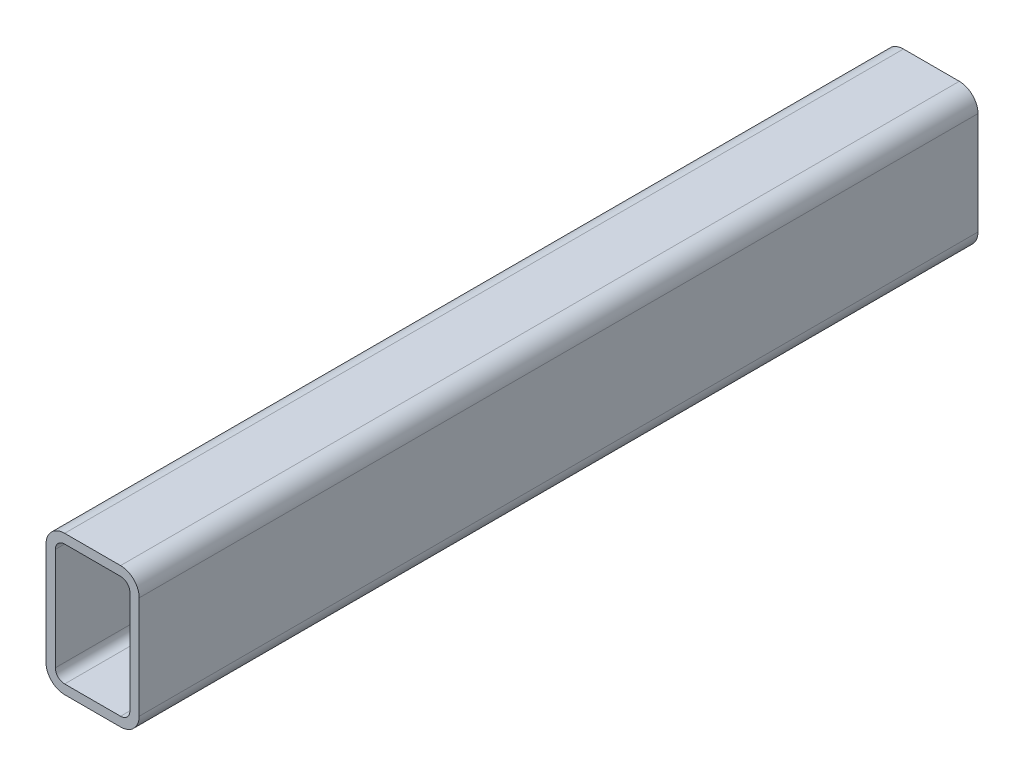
ISO-10303-21;
HEADER;
FILE_DESCRIPTION(('STEP AP214'),'2;1');
FILE_NAME('part.step','',(''),(''),'','','');
FILE_SCHEMA(('AUTOMOTIVE_DESIGN { 1 0 10303 214 1 1 1 1 }'));
ENDSEC;
DATA;
#1=APPLICATION_CONTEXT('core data for automotive mechanical design processes');
#2=APPLICATION_PROTOCOL_DEFINITION('international standard','automotive_design',2000,#1);
#3=PRODUCT_CONTEXT('',#1,'mechanical');
#4=PRODUCT('Part','Part','',(#3));
#5=PRODUCT_RELATED_PRODUCT_CATEGORY('part','',(#4));
#6=PRODUCT_DEFINITION_FORMATION('','',#4);
#7=PRODUCT_DEFINITION_CONTEXT('part definition',#1,'design');
#8=PRODUCT_DEFINITION('design','',#6,#7);
#9=PRODUCT_DEFINITION_SHAPE('','',#8);
#10=(LENGTH_UNIT() NAMED_UNIT(*) SI_UNIT(.MILLI.,.METRE.));
#11=(NAMED_UNIT(*) PLANE_ANGLE_UNIT() SI_UNIT($,.RADIAN.));
#12=(NAMED_UNIT(*) SI_UNIT($,.STERADIAN.) SOLID_ANGLE_UNIT());
#13=UNCERTAINTY_MEASURE_WITH_UNIT(LENGTH_MEASURE(1.E-05),#10,'distance_accuracy_value','');
#14=(GEOMETRIC_REPRESENTATION_CONTEXT(3) GLOBAL_UNCERTAINTY_ASSIGNED_CONTEXT((#13)) GLOBAL_UNIT_ASSIGNED_CONTEXT((#10,
#11,#12)) REPRESENTATION_CONTEXT('',''));
#15=CARTESIAN_POINT('',(0.,0.,0.));
#16=DIRECTION('',(0.,0.,1.));
#17=DIRECTION('',(1.,0.,0.));
#18=AXIS2_PLACEMENT_3D('',#15,#16,#17);
#19=CARTESIAN_POINT('',(20.,20.,450.));
#20=DIRECTION('',(0.,0.,1.));
#21=DIRECTION('',(1.,0.,0.));
#22=AXIS2_PLACEMENT_3D('',#19,#20,#21);
#23=PLANE('',#22);
#24=CARTESIAN_POINT('',(20.,20.,450.));
#25=DIRECTION('',(0.,0.,1.));
#26=DIRECTION('',(1.,0.,0.));
#27=AXIS2_PLACEMENT_3D('',#24,#25,#26);
#28=CIRCLE('',#27,20.);
#29=CARTESIAN_POINT('',(0.,20.,450.));
#30=VERTEX_POINT('',#29);
#31=CARTESIAN_POINT('',(20.,0.,450.));
#32=VERTEX_POINT('',#31);
#33=EDGE_CURVE('E225',#30,#32,#28,.T.);
#34=ORIENTED_EDGE('',*,*,#33,.T.);
#35=DIRECTION('',(1.,0.,0.));
#36=VECTOR('',#35,1.);
#37=CARTESIAN_POINT('',(20.,0.,450.));
#38=LINE('',#37,#36);
#39=CARTESIAN_POINT('',(80.0000000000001,0.,450.));
#40=VERTEX_POINT('',#39);
#41=EDGE_CURVE('E228',#32,#40,#38,.T.);
#42=ORIENTED_EDGE('',*,*,#41,.T.);
#43=CARTESIAN_POINT('',(80.0000000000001,20.,450.));
#44=DIRECTION('',(0.,0.,1.));
#45=DIRECTION('',(1.,0.,0.));
#46=AXIS2_PLACEMENT_3D('',#43,#44,#45);
#47=CIRCLE('',#46,20.);
#48=CARTESIAN_POINT('',(100.,20.,450.));
#49=VERTEX_POINT('',#48);
#50=EDGE_CURVE('E230',#40,#49,#47,.T.);
#51=ORIENTED_EDGE('',*,*,#50,.T.);
#52=DIRECTION('',(0.,1.,0.));
#53=VECTOR('',#52,1.);
#54=CARTESIAN_POINT('',(100.,20.,450.));
#55=LINE('',#54,#53);
#56=CARTESIAN_POINT('',(100.,130.,450.));
#57=VERTEX_POINT('',#56);
#58=EDGE_CURVE('E232',#49,#57,#55,.T.);
#59=ORIENTED_EDGE('',*,*,#58,.T.);
#60=CARTESIAN_POINT('',(80.0000000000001,130.,450.));
#61=DIRECTION('',(0.,0.,1.));
#62=DIRECTION('',(1.,0.,0.));
#63=AXIS2_PLACEMENT_3D('',#60,#61,#62);
#64=CIRCLE('',#63,20.);
#65=CARTESIAN_POINT('',(80.0000000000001,150.,450.));
#66=VERTEX_POINT('',#65);
#67=EDGE_CURVE('E234',#57,#66,#64,.T.);
#68=ORIENTED_EDGE('',*,*,#67,.T.);
#69=DIRECTION('',(-1.,0.,0.));
#70=VECTOR('',#69,1.);
#71=CARTESIAN_POINT('',(80.0000000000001,150.,450.));
#72=LINE('',#71,#70);
#73=CARTESIAN_POINT('',(20.,150.,450.));
#74=VERTEX_POINT('',#73);
#75=EDGE_CURVE('E236',#66,#74,#72,.T.);
#76=ORIENTED_EDGE('',*,*,#75,.T.);
#77=CARTESIAN_POINT('',(20.,130.,450.));
#78=DIRECTION('',(0.,0.,1.));
#79=DIRECTION('',(1.,0.,0.));
#80=AXIS2_PLACEMENT_3D('',#77,#78,#79);
#81=CIRCLE('',#80,20.);
#82=CARTESIAN_POINT('',(0.,130.,450.));
#83=VERTEX_POINT('',#82);
#84=EDGE_CURVE('E238',#74,#83,#81,.T.);
#85=ORIENTED_EDGE('',*,*,#84,.T.);
#86=DIRECTION('',(0.,-1.,0.));
#87=VECTOR('',#86,1.);
#88=CARTESIAN_POINT('',(0.,130.,450.));
#89=LINE('',#88,#87);
#90=EDGE_CURVE('E240',#83,#30,#89,.T.);
#91=ORIENTED_EDGE('',*,*,#90,.T.);
#92=EDGE_LOOP('',(#34,#42,#51,#59,#68,#76,#85,#91));
#93=FACE_BOUND('',#92,.T.);
#94=DIRECTION('',(-1.,0.,0.));
#95=VECTOR('',#94,1.);
#96=CARTESIAN_POINT('',(80.0000000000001,140.,450.));
#97=LINE('',#96,#95);
#98=CARTESIAN_POINT('',(80.0000000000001,140.,450.));
#99=VERTEX_POINT('',#98);
#100=CARTESIAN_POINT('',(20.,140.,450.));
#101=VERTEX_POINT('',#100);
#102=EDGE_CURVE('E183',#99,#101,#97,.T.);
#103=ORIENTED_EDGE('',*,*,#102,.F.);
#104=CARTESIAN_POINT('',(80.0000000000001,130.,450.));
#105=DIRECTION('',(0.,0.,1.));
#106=DIRECTION('',(1.,0.,0.));
#107=AXIS2_PLACEMENT_3D('',#104,#105,#106);
#108=CIRCLE('',#107,9.99999999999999);
#109=CARTESIAN_POINT('',(89.9999999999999,130.,450.));
#110=VERTEX_POINT('',#109);
#111=EDGE_CURVE('E160',#110,#99,#108,.T.);
#112=ORIENTED_EDGE('',*,*,#111,.F.);
#113=DIRECTION('',(0.,1.,0.));
#114=VECTOR('',#113,1.);
#115=CARTESIAN_POINT('',(89.9999999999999,20.,450.));
#116=LINE('',#115,#114);
#117=CARTESIAN_POINT('',(89.9999999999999,20.,450.));
#118=VERTEX_POINT('',#117);
#119=EDGE_CURVE('E195',#118,#110,#116,.T.);
#120=ORIENTED_EDGE('',*,*,#119,.F.);
#121=CARTESIAN_POINT('',(80.0000000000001,20.,450.));
#122=DIRECTION('',(0.,0.,1.));
#123=DIRECTION('',(1.,0.,0.));
#124=AXIS2_PLACEMENT_3D('',#121,#122,#123);
#125=CIRCLE('',#124,9.99999999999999);
#126=CARTESIAN_POINT('',(80.0000000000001,10.,450.));
#127=VERTEX_POINT('',#126);
#128=EDGE_CURVE('E193',#127,#118,#125,.T.);
#129=ORIENTED_EDGE('',*,*,#128,.F.);
#130=DIRECTION('',(1.,0.,0.));
#131=VECTOR('',#130,1.);
#132=CARTESIAN_POINT('',(20.,10.,450.));
#133=LINE('',#132,#131);
#134=CARTESIAN_POINT('',(20.,10.,450.));
#135=VERTEX_POINT('',#134);
#136=EDGE_CURVE('E191',#135,#127,#133,.T.);
#137=ORIENTED_EDGE('',*,*,#136,.F.);
#138=CARTESIAN_POINT('',(20.,20.,450.));
#139=DIRECTION('',(0.,0.,1.));
#140=DIRECTION('',(1.,0.,0.));
#141=AXIS2_PLACEMENT_3D('',#138,#139,#140);
#142=CIRCLE('',#141,10.);
#143=CARTESIAN_POINT('',(9.99999999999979,20.,450.));
#144=VERTEX_POINT('',#143);
#145=EDGE_CURVE('E189',#144,#135,#142,.T.);
#146=ORIENTED_EDGE('',*,*,#145,.F.);
#147=DIRECTION('',(0.,-1.,0.));
#148=VECTOR('',#147,1.);
#149=CARTESIAN_POINT('',(9.99999999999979,130.,450.));
#150=LINE('',#149,#148);
#151=CARTESIAN_POINT('',(9.99999999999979,130.,450.));
#152=VERTEX_POINT('',#151);
#153=EDGE_CURVE('E187',#152,#144,#150,.T.);
#154=ORIENTED_EDGE('',*,*,#153,.F.);
#155=CARTESIAN_POINT('',(20.,130.,450.));
#156=DIRECTION('',(0.,0.,1.));
#157=DIRECTION('',(1.,0.,0.));
#158=AXIS2_PLACEMENT_3D('',#155,#156,#157);
#159=CIRCLE('',#158,9.99999999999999);
#160=EDGE_CURVE('E185',#101,#152,#159,.T.);
#161=ORIENTED_EDGE('',*,*,#160,.F.);
#162=EDGE_LOOP('',(#103,#112,#120,#129,#137,#146,#154,#161));
#163=FACE_BOUND('',#162,.T.);
#164=ADVANCED_FACE('F32',(#93,#163),#23,.T.);
#165=CARTESIAN_POINT('',(20.,20.,-450.));
#166=DIRECTION('',(0.,0.,1.));
#167=DIRECTION('',(1.,0.,0.));
#168=AXIS2_PLACEMENT_3D('',#165,#166,#167);
#169=PLANE('',#168);
#170=CARTESIAN_POINT('',(20.,20.,-450.));
#171=DIRECTION('',(0.,0.,1.));
#172=DIRECTION('',(1.,0.,0.));
#173=AXIS2_PLACEMENT_3D('',#170,#171,#172);
#174=CIRCLE('',#173,20.);
#175=CARTESIAN_POINT('',(0.,20.,-450.));
#176=VERTEX_POINT('',#175);
#177=CARTESIAN_POINT('',(20.,0.,-450.));
#178=VERTEX_POINT('',#177);
#179=EDGE_CURVE('E161',#176,#178,#174,.T.);
#180=ORIENTED_EDGE('',*,*,#179,.F.);
#181=DIRECTION('',(0.,-1.,0.));
#182=VECTOR('',#181,1.);
#183=CARTESIAN_POINT('',(0.,130.,-450.));
#184=LINE('',#183,#182);
#185=CARTESIAN_POINT('',(0.,130.,-450.));
#186=VERTEX_POINT('',#185);
#187=EDGE_CURVE('E223',#186,#176,#184,.T.);
#188=ORIENTED_EDGE('',*,*,#187,.F.);
#189=CARTESIAN_POINT('',(20.,130.,-450.));
#190=DIRECTION('',(0.,0.,1.));
#191=DIRECTION('',(1.,0.,0.));
#192=AXIS2_PLACEMENT_3D('',#189,#190,#191);
#193=CIRCLE('',#192,20.);
#194=CARTESIAN_POINT('',(20.,150.,-450.));
#195=VERTEX_POINT('',#194);
#196=EDGE_CURVE('E221',#195,#186,#193,.T.);
#197=ORIENTED_EDGE('',*,*,#196,.F.);
#198=DIRECTION('',(-1.,0.,0.));
#199=VECTOR('',#198,1.);
#200=CARTESIAN_POINT('',(80.0000000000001,150.,-450.));
#201=LINE('',#200,#199);
#202=CARTESIAN_POINT('',(80.0000000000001,150.,-450.));
#203=VERTEX_POINT('',#202);
#204=EDGE_CURVE('E219',#203,#195,#201,.T.);
#205=ORIENTED_EDGE('',*,*,#204,.F.);
#206=CARTESIAN_POINT('',(80.0000000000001,130.,-450.));
#207=DIRECTION('',(0.,0.,1.));
#208=DIRECTION('',(1.,0.,0.));
#209=AXIS2_PLACEMENT_3D('',#206,#207,#208);
#210=CIRCLE('',#209,20.);
#211=CARTESIAN_POINT('',(100.,130.,-450.));
#212=VERTEX_POINT('',#211);
#213=EDGE_CURVE('E217',#212,#203,#210,.T.);
#214=ORIENTED_EDGE('',*,*,#213,.F.);
#215=DIRECTION('',(0.,1.,0.));
#216=VECTOR('',#215,1.);
#217=CARTESIAN_POINT('',(100.,20.,-450.));
#218=LINE('',#217,#216);
#219=CARTESIAN_POINT('',(100.,20.,-450.));
#220=VERTEX_POINT('',#219);
#221=EDGE_CURVE('E215',#220,#212,#218,.T.);
#222=ORIENTED_EDGE('',*,*,#221,.F.);
#223=CARTESIAN_POINT('',(80.0000000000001,20.,-450.));
#224=DIRECTION('',(0.,0.,1.));
#225=DIRECTION('',(1.,0.,0.));
#226=AXIS2_PLACEMENT_3D('',#223,#224,#225);
#227=CIRCLE('',#226,20.);
#228=CARTESIAN_POINT('',(80.0000000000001,0.,-450.));
#229=VERTEX_POINT('',#228);
#230=EDGE_CURVE('E213',#229,#220,#227,.T.);
#231=ORIENTED_EDGE('',*,*,#230,.F.);
#232=DIRECTION('',(1.,0.,0.));
#233=VECTOR('',#232,1.);
#234=CARTESIAN_POINT('',(20.,0.,-450.));
#235=LINE('',#234,#233);
#236=EDGE_CURVE('E211',#178,#229,#235,.T.);
#237=ORIENTED_EDGE('',*,*,#236,.F.);
#238=EDGE_LOOP('',(#180,#188,#197,#205,#214,#222,#231,#237));
#239=FACE_BOUND('',#238,.T.);
#240=CARTESIAN_POINT('',(80.0000000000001,130.,-450.));
#241=DIRECTION('',(0.,0.,1.));
#242=DIRECTION('',(1.,0.,0.));
#243=AXIS2_PLACEMENT_3D('',#240,#241,#242);
#244=CIRCLE('',#243,9.99999999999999);
#245=CARTESIAN_POINT('',(90.0000000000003,130.,-450.));
#246=VERTEX_POINT('',#245);
#247=CARTESIAN_POINT('',(80.0000000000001,140.,-450.));
#248=VERTEX_POINT('',#247);
#249=EDGE_CURVE('E55',#246,#248,#244,.T.);
#250=ORIENTED_EDGE('',*,*,#249,.T.);
#251=DIRECTION('',(-1.,0.,0.));
#252=VECTOR('',#251,1.);
#253=CARTESIAN_POINT('',(80.0000000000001,140.,-450.));
#254=LINE('',#253,#252);
#255=CARTESIAN_POINT('',(20.,140.,-450.));
#256=VERTEX_POINT('',#255);
#257=EDGE_CURVE('E147',#248,#256,#254,.T.);
#258=ORIENTED_EDGE('',*,*,#257,.T.);
#259=CARTESIAN_POINT('',(20.,130.,-450.));
#260=DIRECTION('',(0.,0.,1.));
#261=DIRECTION('',(1.,0.,0.));
#262=AXIS2_PLACEMENT_3D('',#259,#260,#261);
#263=CIRCLE('',#262,9.99999999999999);
#264=CARTESIAN_POINT('',(10.0000000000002,130.,-450.));
#265=VERTEX_POINT('',#264);
#266=EDGE_CURVE('E156',#256,#265,#263,.T.);
#267=ORIENTED_EDGE('',*,*,#266,.T.);
#268=DIRECTION('',(0.,-1.,0.));
#269=VECTOR('',#268,1.);
#270=CARTESIAN_POINT('',(10.0000000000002,130.,-450.));
#271=LINE('',#270,#269);
#272=CARTESIAN_POINT('',(10.0000000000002,20.,-450.));
#273=VERTEX_POINT('',#272);
#274=EDGE_CURVE('E170',#265,#273,#271,.T.);
#275=ORIENTED_EDGE('',*,*,#274,.T.);
#276=CARTESIAN_POINT('',(20.,20.,-450.));
#277=DIRECTION('',(0.,0.,1.));
#278=DIRECTION('',(1.,0.,0.));
#279=AXIS2_PLACEMENT_3D('',#276,#277,#278);
#280=CIRCLE('',#279,10.);
#281=CARTESIAN_POINT('',(20.,10.,-450.));
#282=VERTEX_POINT('',#281);
#283=EDGE_CURVE('E173',#273,#282,#280,.T.);
#284=ORIENTED_EDGE('',*,*,#283,.T.);
#285=DIRECTION('',(1.,0.,0.));
#286=VECTOR('',#285,1.);
#287=CARTESIAN_POINT('',(20.,10.,-450.));
#288=LINE('',#287,#286);
#289=CARTESIAN_POINT('',(80.0000000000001,10.,-450.));
#290=VERTEX_POINT('',#289);
#291=EDGE_CURVE('E176',#282,#290,#288,.T.);
#292=ORIENTED_EDGE('',*,*,#291,.T.);
#293=CARTESIAN_POINT('',(80.0000000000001,20.,-450.));
#294=DIRECTION('',(0.,0.,1.));
#295=DIRECTION('',(1.,0.,0.));
#296=AXIS2_PLACEMENT_3D('',#293,#294,#295);
#297=CIRCLE('',#296,9.99999999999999);
#298=CARTESIAN_POINT('',(90.0000000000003,20.,-450.));
#299=VERTEX_POINT('',#298);
#300=EDGE_CURVE('E179',#290,#299,#297,.T.);
#301=ORIENTED_EDGE('',*,*,#300,.T.);
#302=DIRECTION('',(0.,1.,0.));
#303=VECTOR('',#302,1.);
#304=CARTESIAN_POINT('',(90.0000000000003,20.,-450.));
#305=LINE('',#304,#303);
#306=EDGE_CURVE('E166',#299,#246,#305,.T.);
#307=ORIENTED_EDGE('',*,*,#306,.T.);
#308=EDGE_LOOP('',(#250,#258,#267,#275,#284,#292,#301,#307));
#309=FACE_BOUND('',#308,.T.);
#310=ADVANCED_FACE('F164',(#239,#309),#169,.F.);
#311=CARTESIAN_POINT('',(20.,20.,450.));
#312=DIRECTION('',(0.,0.,-1.));
#313=DIRECTION('',(-1.,0.,0.));
#314=AXIS2_PLACEMENT_3D('',#311,#312,#313);
#315=CYLINDRICAL_SURFACE('',#314,20.);
#316=ORIENTED_EDGE('',*,*,#179,.T.);
#317=DIRECTION('',(0.,0.,-1.));
#318=VECTOR('',#317,1.);
#319=CARTESIAN_POINT('',(20.,0.,450.));
#320=LINE('',#319,#318);
#321=EDGE_CURVE('E11',#32,#178,#320,.T.);
#322=ORIENTED_EDGE('',*,*,#321,.F.);
#323=ORIENTED_EDGE('',*,*,#33,.F.);
#324=DIRECTION('',(0.,0.,-1.));
#325=VECTOR('',#324,1.);
#326=CARTESIAN_POINT('',(0.,20.,450.));
#327=LINE('',#326,#325);
#328=EDGE_CURVE('E242',#30,#176,#327,.T.);
#329=ORIENTED_EDGE('',*,*,#328,.T.);
#330=EDGE_LOOP('',(#316,#322,#323,#329));
#331=FACE_BOUND('',#330,.T.);
#332=ADVANCED_FACE('F34',(#331),#315,.T.);
#333=CARTESIAN_POINT('',(20.,0.,450.));
#334=DIRECTION('',(0.,1.,0.));
#335=DIRECTION('',(0.,0.,1.));
#336=AXIS2_PLACEMENT_3D('',#333,#334,#335);
#337=PLANE('',#336);
#338=ORIENTED_EDGE('',*,*,#236,.T.);
#339=DIRECTION('',(0.,0.,-1.));
#340=VECTOR('',#339,1.);
#341=CARTESIAN_POINT('',(80.0000000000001,0.,450.));
#342=LINE('',#341,#340);
#343=EDGE_CURVE('E40',#40,#229,#342,.T.);
#344=ORIENTED_EDGE('',*,*,#343,.F.);
#345=ORIENTED_EDGE('',*,*,#41,.F.);
#346=ORIENTED_EDGE('',*,*,#321,.T.);
#347=EDGE_LOOP('',(#338,#344,#345,#346));
#348=FACE_BOUND('',#347,.T.);
#349=ADVANCED_FACE('F286',(#348),#337,.F.);
#350=CARTESIAN_POINT('',(80.0000000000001,20.,450.));
#351=DIRECTION('',(0.,0.,-1.));
#352=DIRECTION('',(-1.,0.,0.));
#353=AXIS2_PLACEMENT_3D('',#350,#351,#352);
#354=CYLINDRICAL_SURFACE('',#353,20.);
#355=ORIENTED_EDGE('',*,*,#230,.T.);
#356=DIRECTION('',(0.,0.,-1.));
#357=VECTOR('',#356,1.);
#358=CARTESIAN_POINT('',(100.,20.,450.));
#359=LINE('',#358,#357);
#360=EDGE_CURVE('E257',#49,#220,#359,.T.);
#361=ORIENTED_EDGE('',*,*,#360,.F.);
#362=ORIENTED_EDGE('',*,*,#50,.F.);
#363=ORIENTED_EDGE('',*,*,#343,.T.);
#364=EDGE_LOOP('',(#355,#361,#362,#363));
#365=FACE_BOUND('',#364,.T.);
#366=ADVANCED_FACE('F264',(#365),#354,.T.);
#367=CARTESIAN_POINT('',(100.,20.,450.));
#368=DIRECTION('',(-1.,0.,0.));
#369=DIRECTION('',(0.,0.,1.));
#370=AXIS2_PLACEMENT_3D('',#367,#368,#369);
#371=PLANE('',#370);
#372=ORIENTED_EDGE('',*,*,#221,.T.);
#373=DIRECTION('',(0.,0.,-1.));
#374=VECTOR('',#373,1.);
#375=CARTESIAN_POINT('',(100.,130.,450.));
#376=LINE('',#375,#374);
#377=EDGE_CURVE('E254',#57,#212,#376,.T.);
#378=ORIENTED_EDGE('',*,*,#377,.F.);
#379=ORIENTED_EDGE('',*,*,#58,.F.);
#380=ORIENTED_EDGE('',*,*,#360,.T.);
#381=EDGE_LOOP('',(#372,#378,#379,#380));
#382=FACE_BOUND('',#381,.T.);
#383=ADVANCED_FACE('F274',(#382),#371,.F.);
#384=CARTESIAN_POINT('',(80.0000000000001,130.,450.));
#385=DIRECTION('',(0.,0.,-1.));
#386=DIRECTION('',(-1.,0.,0.));
#387=AXIS2_PLACEMENT_3D('',#384,#385,#386);
#388=CYLINDRICAL_SURFACE('',#387,20.);
#389=ORIENTED_EDGE('',*,*,#213,.T.);
#390=DIRECTION('',(0.,0.,-1.));
#391=VECTOR('',#390,1.);
#392=CARTESIAN_POINT('',(80.0000000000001,150.,450.));
#393=LINE('',#392,#391);
#394=EDGE_CURVE('E251',#66,#203,#393,.T.);
#395=ORIENTED_EDGE('',*,*,#394,.F.);
#396=ORIENTED_EDGE('',*,*,#67,.F.);
#397=ORIENTED_EDGE('',*,*,#377,.T.);
#398=EDGE_LOOP('',(#389,#395,#396,#397));
#399=FACE_BOUND('',#398,.T.);
#400=ADVANCED_FACE('F278',(#399),#388,.T.);
#401=CARTESIAN_POINT('',(80.0000000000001,150.,450.));
#402=DIRECTION('',(0.,-1.,0.));
#403=DIRECTION('',(0.,0.,-1.));
#404=AXIS2_PLACEMENT_3D('',#401,#402,#403);
#405=PLANE('',#404);
#406=ORIENTED_EDGE('',*,*,#204,.T.);
#407=DIRECTION('',(0.,0.,-1.));
#408=VECTOR('',#407,1.);
#409=CARTESIAN_POINT('',(20.,150.,450.));
#410=LINE('',#409,#408);
#411=EDGE_CURVE('E248',#74,#195,#410,.T.);
#412=ORIENTED_EDGE('',*,*,#411,.F.);
#413=ORIENTED_EDGE('',*,*,#75,.F.);
#414=ORIENTED_EDGE('',*,*,#394,.T.);
#415=EDGE_LOOP('',(#406,#412,#413,#414));
#416=FACE_BOUND('',#415,.T.);
#417=ADVANCED_FACE('F299',(#416),#405,.F.);
#418=CARTESIAN_POINT('',(20.,130.,450.));
#419=DIRECTION('',(0.,0.,-1.));
#420=DIRECTION('',(-1.,0.,0.));
#421=AXIS2_PLACEMENT_3D('',#418,#419,#420);
#422=CYLINDRICAL_SURFACE('',#421,20.);
#423=ORIENTED_EDGE('',*,*,#196,.T.);
#424=DIRECTION('',(0.,0.,-1.));
#425=VECTOR('',#424,1.);
#426=CARTESIAN_POINT('',(0.,130.,450.));
#427=LINE('',#426,#425);
#428=EDGE_CURVE('E245',#83,#186,#427,.T.);
#429=ORIENTED_EDGE('',*,*,#428,.F.);
#430=ORIENTED_EDGE('',*,*,#84,.F.);
#431=ORIENTED_EDGE('',*,*,#411,.T.);
#432=EDGE_LOOP('',(#423,#429,#430,#431));
#433=FACE_BOUND('',#432,.T.);
#434=ADVANCED_FACE('F297',(#433),#422,.T.);
#435=CARTESIAN_POINT('',(0.,130.,450.));
#436=DIRECTION('',(1.,0.,0.));
#437=DIRECTION('',(0.,0.,-1.));
#438=AXIS2_PLACEMENT_3D('',#435,#436,#437);
#439=PLANE('',#438);
#440=ORIENTED_EDGE('',*,*,#187,.T.);
#441=ORIENTED_EDGE('',*,*,#328,.F.);
#442=ORIENTED_EDGE('',*,*,#90,.F.);
#443=ORIENTED_EDGE('',*,*,#428,.T.);
#444=EDGE_LOOP('',(#440,#441,#442,#443));
#445=FACE_BOUND('',#444,.T.);
#446=ADVANCED_FACE('F292',(#445),#439,.F.);
#447=CARTESIAN_POINT('',(80.0000000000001,130.,450.));
#448=DIRECTION('',(0.,0.,-1.));
#449=DIRECTION('',(-1.,0.,0.));
#450=AXIS2_PLACEMENT_3D('',#447,#448,#449);
#451=CYLINDRICAL_SURFACE('',#450,9.99999999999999);
#452=ORIENTED_EDGE('',*,*,#249,.F.);
#453=DIRECTION('',(0.,0.,-1.));
#454=VECTOR('',#453,1.);
#455=CARTESIAN_POINT('',(89.9999999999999,130.,450.));
#456=LINE('',#455,#454);
#457=EDGE_CURVE('E197',#110,#246,#456,.T.);
#458=ORIENTED_EDGE('',*,*,#457,.F.);
#459=ORIENTED_EDGE('',*,*,#111,.T.);
#460=DIRECTION('',(0.,0.,-1.));
#461=VECTOR('',#460,1.);
#462=CARTESIAN_POINT('',(80.0000000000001,140.,450.));
#463=LINE('',#462,#461);
#464=EDGE_CURVE('E149',#99,#248,#463,.T.);
#465=ORIENTED_EDGE('',*,*,#464,.T.);
#466=EDGE_LOOP('',(#452,#458,#459,#465));
#467=FACE_BOUND('',#466,.T.);
#468=ADVANCED_FACE('F158',(#467),#451,.F.);
#469=CARTESIAN_POINT('',(80.0000000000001,140.,450.));
#470=DIRECTION('',(0.,-1.,0.));
#471=DIRECTION('',(0.,0.,-1.));
#472=AXIS2_PLACEMENT_3D('',#469,#470,#471);
#473=PLANE('',#472);
#474=ORIENTED_EDGE('',*,*,#257,.F.);
#475=ORIENTED_EDGE('',*,*,#464,.F.);
#476=ORIENTED_EDGE('',*,*,#102,.T.);
#477=DIRECTION('',(0.,0.,-1.));
#478=VECTOR('',#477,1.);
#479=CARTESIAN_POINT('',(20.,140.,450.));
#480=LINE('',#479,#478);
#481=EDGE_CURVE('E152',#101,#256,#480,.T.);
#482=ORIENTED_EDGE('',*,*,#481,.T.);
#483=EDGE_LOOP('',(#474,#475,#476,#482));
#484=FACE_BOUND('',#483,.T.);
#485=ADVANCED_FACE('F148',(#484),#473,.T.);
#486=CARTESIAN_POINT('',(20.,130.,450.));
#487=DIRECTION('',(0.,0.,-1.));
#488=DIRECTION('',(-1.,0.,0.));
#489=AXIS2_PLACEMENT_3D('',#486,#487,#488);
#490=CYLINDRICAL_SURFACE('',#489,9.99999999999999);
#491=ORIENTED_EDGE('',*,*,#266,.F.);
#492=ORIENTED_EDGE('',*,*,#481,.F.);
#493=ORIENTED_EDGE('',*,*,#160,.T.);
#494=DIRECTION('',(0.,0.,-1.));
#495=VECTOR('',#494,1.);
#496=CARTESIAN_POINT('',(9.99999999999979,130.,450.));
#497=LINE('',#496,#495);
#498=EDGE_CURVE('E206',#152,#265,#497,.T.);
#499=ORIENTED_EDGE('',*,*,#498,.T.);
#500=EDGE_LOOP('',(#491,#492,#493,#499));
#501=FACE_BOUND('',#500,.T.);
#502=ADVANCED_FACE('F323',(#501),#490,.F.);
#503=CARTESIAN_POINT('',(9.99999999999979,130.,450.));
#504=DIRECTION('',(1.,0.,0.));
#505=DIRECTION('',(0.,1.,0.));
#506=AXIS2_PLACEMENT_3D('',#503,#504,#505);
#507=PLANE('',#506);
#508=ORIENTED_EDGE('',*,*,#274,.F.);
#509=ORIENTED_EDGE('',*,*,#498,.F.);
#510=ORIENTED_EDGE('',*,*,#153,.T.);
#511=DIRECTION('',(0.,0.,-1.));
#512=VECTOR('',#511,1.);
#513=CARTESIAN_POINT('',(9.99999999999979,20.,450.));
#514=LINE('',#513,#512);
#515=EDGE_CURVE('E204',#144,#273,#514,.T.);
#516=ORIENTED_EDGE('',*,*,#515,.T.);
#517=EDGE_LOOP('',(#508,#509,#510,#516));
#518=FACE_BOUND('',#517,.T.);
#519=ADVANCED_FACE('F328',(#518),#507,.T.);
#520=CARTESIAN_POINT('',(20.,20.,450.));
#521=DIRECTION('',(0.,0.,-1.));
#522=DIRECTION('',(-1.,0.,0.));
#523=AXIS2_PLACEMENT_3D('',#520,#521,#522);
#524=CYLINDRICAL_SURFACE('',#523,10.);
#525=ORIENTED_EDGE('',*,*,#283,.F.);
#526=ORIENTED_EDGE('',*,*,#515,.F.);
#527=ORIENTED_EDGE('',*,*,#145,.T.);
#528=DIRECTION('',(0.,0.,-1.));
#529=VECTOR('',#528,1.);
#530=CARTESIAN_POINT('',(20.,10.,450.));
#531=LINE('',#530,#529);
#532=EDGE_CURVE('E202',#135,#282,#531,.T.);
#533=ORIENTED_EDGE('',*,*,#532,.T.);
#534=EDGE_LOOP('',(#525,#526,#527,#533));
#535=FACE_BOUND('',#534,.T.);
#536=ADVANCED_FACE('F332',(#535),#524,.F.);
#537=CARTESIAN_POINT('',(20.,10.,450.));
#538=DIRECTION('',(0.,1.,0.));
#539=DIRECTION('',(0.,0.,1.));
#540=AXIS2_PLACEMENT_3D('',#537,#538,#539);
#541=PLANE('',#540);
#542=ORIENTED_EDGE('',*,*,#291,.F.);
#543=ORIENTED_EDGE('',*,*,#532,.F.);
#544=ORIENTED_EDGE('',*,*,#136,.T.);
#545=DIRECTION('',(0.,0.,-1.));
#546=VECTOR('',#545,1.);
#547=CARTESIAN_POINT('',(80.0000000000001,10.,450.));
#548=LINE('',#547,#546);
#549=EDGE_CURVE('E200',#127,#290,#548,.T.);
#550=ORIENTED_EDGE('',*,*,#549,.T.);
#551=EDGE_LOOP('',(#542,#543,#544,#550));
#552=FACE_BOUND('',#551,.T.);
#553=ADVANCED_FACE('F336',(#552),#541,.T.);
#554=CARTESIAN_POINT('',(80.0000000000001,20.,450.));
#555=DIRECTION('',(0.,0.,-1.));
#556=DIRECTION('',(-1.,0.,0.));
#557=AXIS2_PLACEMENT_3D('',#554,#555,#556);
#558=CYLINDRICAL_SURFACE('',#557,9.99999999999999);
#559=ORIENTED_EDGE('',*,*,#300,.F.);
#560=ORIENTED_EDGE('',*,*,#549,.F.);
#561=ORIENTED_EDGE('',*,*,#128,.T.);
#562=DIRECTION('',(0.,0.,-1.));
#563=VECTOR('',#562,1.);
#564=CARTESIAN_POINT('',(89.9999999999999,20.,450.));
#565=LINE('',#564,#563);
#566=EDGE_CURVE('E47',#118,#299,#565,.T.);
#567=ORIENTED_EDGE('',*,*,#566,.T.);
#568=EDGE_LOOP('',(#559,#560,#561,#567));
#569=FACE_BOUND('',#568,.T.);
#570=ADVANCED_FACE('F340',(#569),#558,.F.);
#571=CARTESIAN_POINT('',(89.9999999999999,20.,450.));
#572=DIRECTION('',(-1.,0.,0.));
#573=DIRECTION('',(0.,-1.,0.));
#574=AXIS2_PLACEMENT_3D('',#571,#572,#573);
#575=PLANE('',#574);
#576=ORIENTED_EDGE('',*,*,#306,.F.);
#577=ORIENTED_EDGE('',*,*,#566,.F.);
#578=ORIENTED_EDGE('',*,*,#119,.T.);
#579=ORIENTED_EDGE('',*,*,#457,.T.);
#580=EDGE_LOOP('',(#576,#577,#578,#579));
#581=FACE_BOUND('',#580,.T.);
#582=ADVANCED_FACE('F344',(#581),#575,.T.);
#583=CLOSED_SHELL('',(#164,#310,#332,#349,#366,#383,#400,#417,#434,#446,#468,#485,#502,#519,
#536,#553,#570,#582));
#584=MANIFOLD_SOLID_BREP('B2',#583);
#585=ADVANCED_BREP_SHAPE_REPRESENTATION('',(#18,#584),#14);
#586=SHAPE_DEFINITION_REPRESENTATION(#9,#585);
ENDSEC;
END-ISO-10303-21;
